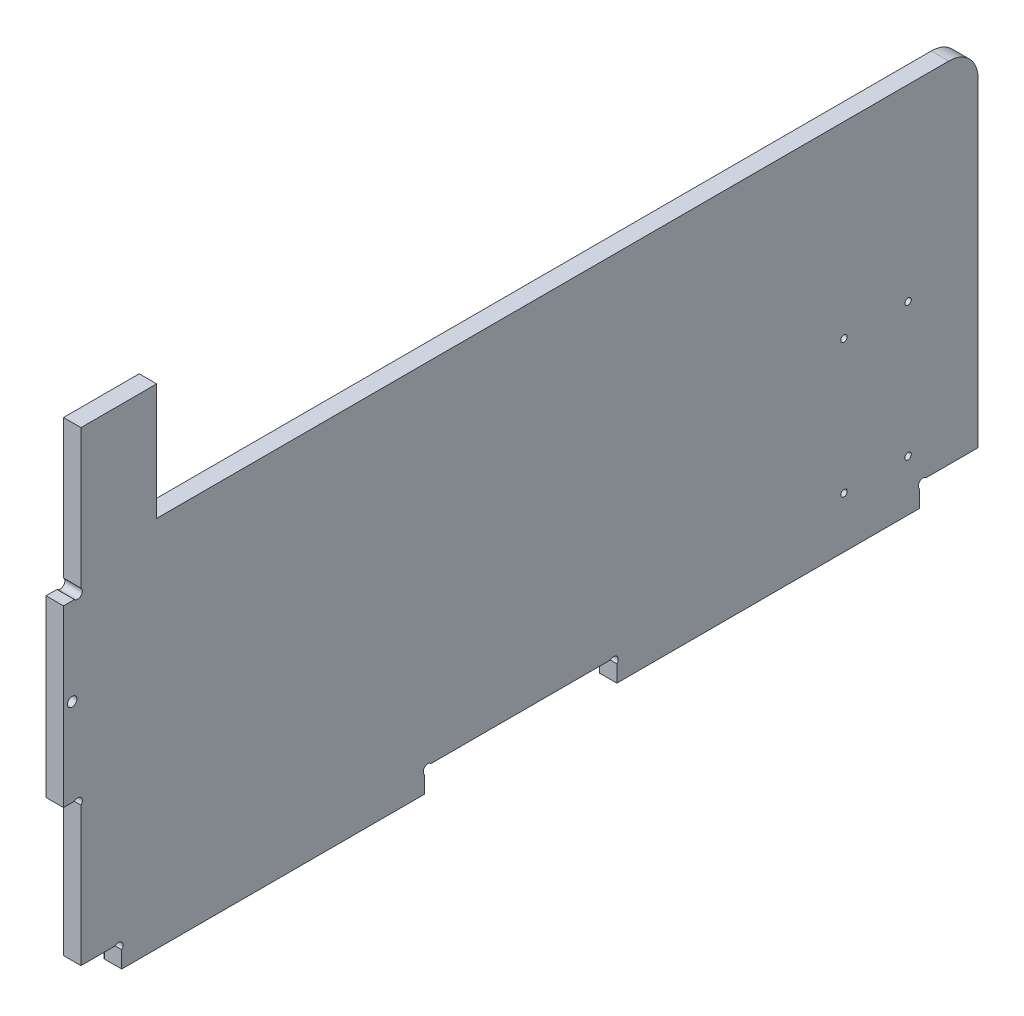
ISO-10303-21;
HEADER;
FILE_DESCRIPTION(('STEP AP214'),'2;1');
FILE_NAME('part.step','',(''),(''),'','','');
FILE_SCHEMA(('AUTOMOTIVE_DESIGN { 1 0 10303 214 1 1 1 1 }'));
ENDSEC;
DATA;
#1=APPLICATION_CONTEXT('core data for automotive mechanical design processes');
#2=APPLICATION_PROTOCOL_DEFINITION('international standard','automotive_design',2000,#1);
#3=PRODUCT_CONTEXT('',#1,'mechanical');
#4=PRODUCT('Part','Part','',(#3));
#5=PRODUCT_RELATED_PRODUCT_CATEGORY('part','',(#4));
#6=PRODUCT_DEFINITION_FORMATION('','',#4);
#7=PRODUCT_DEFINITION_CONTEXT('part definition',#1,'design');
#8=PRODUCT_DEFINITION('design','',#6,#7);
#9=PRODUCT_DEFINITION_SHAPE('','',#8);
#10=(LENGTH_UNIT() NAMED_UNIT(*) SI_UNIT(.MILLI.,.METRE.));
#11=(NAMED_UNIT(*) PLANE_ANGLE_UNIT() SI_UNIT($,.RADIAN.));
#12=(NAMED_UNIT(*) SI_UNIT($,.STERADIAN.) SOLID_ANGLE_UNIT());
#13=UNCERTAINTY_MEASURE_WITH_UNIT(LENGTH_MEASURE(1.E-05),#10,'distance_accuracy_value','');
#14=(GEOMETRIC_REPRESENTATION_CONTEXT(3) GLOBAL_UNCERTAINTY_ASSIGNED_CONTEXT((#13)) GLOBAL_UNIT_ASSIGNED_CONTEXT((#10,
#11,#12)) REPRESENTATION_CONTEXT('',''));
#15=CARTESIAN_POINT('',(0.,0.,0.));
#16=DIRECTION('',(0.,0.,1.));
#17=DIRECTION('',(1.,0.,0.));
#18=AXIS2_PLACEMENT_3D('',#15,#16,#17);
#19=CARTESIAN_POINT('',(6.,118.,-304.));
#20=DIRECTION('',(-1.,0.,0.));
#21=DIRECTION('',(0.,0.,1.));
#22=AXIS2_PLACEMENT_3D('',#19,#20,#21);
#23=PLANE('',#22);
#24=CARTESIAN_POINT('',(6.,63.5,-268.));
#25=DIRECTION('',(1.,0.,0.));
#26=DIRECTION('',(0.,0.,-1.));
#27=AXIS2_PLACEMENT_3D('',#24,#25,#26);
#28=CIRCLE('',#27,1.09999999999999);
#29=CARTESIAN_POINT('',(6.,63.5,-269.1));
#30=VERTEX_POINT('',#29);
#31=EDGE_CURVE('E453',#30,#30,#28,.T.);
#32=ORIENTED_EDGE('',*,*,#31,.F.);
#33=EDGE_LOOP('',(#32));
#34=FACE_BOUND('',#33,.T.);
#35=CARTESIAN_POINT('',(6.,17.5,-268.));
#36=DIRECTION('',(1.,0.,0.));
#37=DIRECTION('',(0.,0.,-1.));
#38=AXIS2_PLACEMENT_3D('',#35,#36,#37);
#39=CIRCLE('',#38,1.09999999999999);
#40=CARTESIAN_POINT('',(6.,17.5,-269.1));
#41=VERTEX_POINT('',#40);
#42=EDGE_CURVE('E465',#41,#41,#39,.T.);
#43=ORIENTED_EDGE('',*,*,#42,.F.);
#44=EDGE_LOOP('',(#43));
#45=FACE_BOUND('',#44,.T.);
#46=DIRECTION('',(0.,0.,1.));
#47=VECTOR('',#46,1.);
#48=CARTESIAN_POINT('',(6.,168.,-6.00000000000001));
#49=LINE('',#48,#47);
#50=CARTESIAN_POINT('',(6.,168.,-32.));
#51=VERTEX_POINT('',#50);
#52=CARTESIAN_POINT('',(6.,168.,-6.00000000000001));
#53=VERTEX_POINT('',#52);
#54=EDGE_CURVE('E265',#51,#53,#49,.T.);
#55=ORIENTED_EDGE('',*,*,#54,.T.);
#56=DIRECTION('',(0.,-1.,0.));
#57=VECTOR('',#56,1.);
#58=CARTESIAN_POINT('',(6.,120.262741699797,-6.00000000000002));
#59=LINE('',#58,#57);
#60=CARTESIAN_POINT('',(6.,120.262741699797,-6.00000000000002));
#61=VERTEX_POINT('',#60);
#62=EDGE_CURVE('E128',#53,#61,#59,.T.);
#63=ORIENTED_EDGE('',*,*,#62,.T.);
#64=CARTESIAN_POINT('',(6.,119.131370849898,-4.86862915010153));
#65=DIRECTION('',(-1.,0.,0.));
#66=DIRECTION('',(0.,0.,-1.));
#67=AXIS2_PLACEMENT_3D('',#64,#65,#66);
#68=CIRCLE('',#67,1.59999999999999);
#69=CARTESIAN_POINT('',(6.,118.,-3.73725830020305));
#70=VERTEX_POINT('',#69);
#71=EDGE_CURVE('E331',#61,#70,#68,.T.);
#72=ORIENTED_EDGE('',*,*,#71,.T.);
#73=DIRECTION('',(0.,0.,1.));
#74=VECTOR('',#73,1.);
#75=CARTESIAN_POINT('',(6.,118.,-3.73725830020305));
#76=LINE('',#75,#74);
#77=CARTESIAN_POINT('',(6.,118.,0.));
#78=VERTEX_POINT('',#77);
#79=EDGE_CURVE('E350',#70,#78,#76,.T.);
#80=ORIENTED_EDGE('',*,*,#79,.T.);
#81=DIRECTION('',(0.,-1.,0.));
#82=VECTOR('',#81,1.);
#83=CARTESIAN_POINT('',(6.,118.,0.));
#84=LINE('',#83,#82);
#85=CARTESIAN_POINT('',(6.,58.,0.));
#86=VERTEX_POINT('',#85);
#87=EDGE_CURVE('E347',#78,#86,#84,.T.);
#88=ORIENTED_EDGE('',*,*,#87,.T.);
#89=DIRECTION('',(0.,0.,-1.));
#90=VECTOR('',#89,1.);
#91=CARTESIAN_POINT('',(6.,58.,0.));
#92=LINE('',#91,#90);
#93=CARTESIAN_POINT('',(6.,58.,-3.73725830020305));
#94=VERTEX_POINT('',#93);
#95=EDGE_CURVE('E349',#86,#94,#92,.T.);
#96=ORIENTED_EDGE('',*,*,#95,.T.);
#97=CARTESIAN_POINT('',(6.,56.8686291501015,-4.86862915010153));
#98=DIRECTION('',(-1.,0.,0.));
#99=DIRECTION('',(0.,0.,1.));
#100=AXIS2_PLACEMENT_3D('',#97,#98,#99);
#101=CIRCLE('',#100,1.6);
#102=CARTESIAN_POINT('',(6.,55.7372583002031,-6.00000000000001));
#103=VERTEX_POINT('',#102);
#104=EDGE_CURVE('E352',#94,#103,#101,.T.);
#105=ORIENTED_EDGE('',*,*,#104,.T.);
#106=DIRECTION('',(0.,-1.,0.));
#107=VECTOR('',#106,1.);
#108=CARTESIAN_POINT('',(6.,55.7372583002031,-6.00000000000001));
#109=LINE('',#108,#107);
#110=CARTESIAN_POINT('',(6.,8.,-6.00000000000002));
#111=VERTEX_POINT('',#110);
#112=EDGE_CURVE('E358',#103,#111,#109,.T.);
#113=ORIENTED_EDGE('',*,*,#112,.T.);
#114=DIRECTION('',(0.,0.,-1.));
#115=VECTOR('',#114,1.);
#116=CARTESIAN_POINT('',(6.,7.99999999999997,-17.7372583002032));
#117=LINE('',#116,#115);
#118=CARTESIAN_POINT('',(6.,7.99999999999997,-17.7372583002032));
#119=VERTEX_POINT('',#118);
#120=EDGE_CURVE('E360',#111,#119,#117,.T.);
#121=ORIENTED_EDGE('',*,*,#120,.T.);
#122=CARTESIAN_POINT('',(6.,6.86862915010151,-18.8686291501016));
#123=DIRECTION('',(-1.,0.,0.));
#124=DIRECTION('',(0.,0.,1.));
#125=AXIS2_PLACEMENT_3D('',#122,#123,#124);
#126=CIRCLE('',#125,1.59999999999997);
#127=CARTESIAN_POINT('',(6.,5.73725830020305,-20.0000000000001));
#128=VERTEX_POINT('',#127);
#129=EDGE_CURVE('E362',#119,#128,#126,.T.);
#130=ORIENTED_EDGE('',*,*,#129,.T.);
#131=DIRECTION('',(0.,-1.,0.));
#132=VECTOR('',#131,1.);
#133=CARTESIAN_POINT('',(6.,5.73725830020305,-20.0000000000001));
#134=LINE('',#133,#132);
#135=CARTESIAN_POINT('',(6.,0.,-20.0000000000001));
#136=VERTEX_POINT('',#135);
#137=EDGE_CURVE('E364',#128,#136,#134,.T.);
#138=ORIENTED_EDGE('',*,*,#137,.T.);
#139=DIRECTION('',(0.,0.,-1.));
#140=VECTOR('',#139,1.);
#141=CARTESIAN_POINT('',(6.,0.,-20.0000000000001));
#142=LINE('',#141,#140);
#143=CARTESIAN_POINT('',(6.,0.,-124.));
#144=VERTEX_POINT('',#143);
#145=EDGE_CURVE('E366',#136,#144,#142,.T.);
#146=ORIENTED_EDGE('',*,*,#145,.T.);
#147=DIRECTION('',(0.,1.,0.));
#148=VECTOR('',#147,1.);
#149=CARTESIAN_POINT('',(6.,0.,-124.));
#150=LINE('',#149,#148);
#151=CARTESIAN_POINT('',(6.,5.73725830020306,-124.));
#152=VERTEX_POINT('',#151);
#153=EDGE_CURVE('E368',#144,#152,#150,.T.);
#154=ORIENTED_EDGE('',*,*,#153,.T.);
#155=CARTESIAN_POINT('',(6.,6.86862915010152,-125.131370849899));
#156=DIRECTION('',(-1.,0.,0.));
#157=DIRECTION('',(0.,0.,-1.));
#158=AXIS2_PLACEMENT_3D('',#155,#156,#157);
#159=CIRCLE('',#158,1.59999999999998);
#160=CARTESIAN_POINT('',(6.,7.99999999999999,-126.262741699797));
#161=VERTEX_POINT('',#160);
#162=EDGE_CURVE('E370',#152,#161,#159,.T.);
#163=ORIENTED_EDGE('',*,*,#162,.T.);
#164=DIRECTION('',(0.,0.,-1.));
#165=VECTOR('',#164,1.);
#166=CARTESIAN_POINT('',(6.,7.99999999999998,-126.262741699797));
#167=LINE('',#166,#165);
#168=CARTESIAN_POINT('',(6.,7.99999999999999,-187.737258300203));
#169=VERTEX_POINT('',#168);
#170=EDGE_CURVE('E372',#161,#169,#167,.T.);
#171=ORIENTED_EDGE('',*,*,#170,.T.);
#172=CARTESIAN_POINT('',(6.,6.86862915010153,-188.868629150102));
#173=DIRECTION('',(-1.,0.,0.));
#174=DIRECTION('',(0.,0.,1.));
#175=AXIS2_PLACEMENT_3D('',#172,#173,#174);
#176=CIRCLE('',#175,1.59999999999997);
#177=CARTESIAN_POINT('',(6.,5.73725830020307,-190.));
#178=VERTEX_POINT('',#177);
#179=EDGE_CURVE('E374',#169,#178,#176,.T.);
#180=ORIENTED_EDGE('',*,*,#179,.T.);
#181=DIRECTION('',(0.,-1.,0.));
#182=VECTOR('',#181,1.);
#183=CARTESIAN_POINT('',(6.,0.,-190.));
#184=LINE('',#183,#182);
#185=CARTESIAN_POINT('',(6.,0.,-190.));
#186=VERTEX_POINT('',#185);
#187=EDGE_CURVE('E376',#178,#186,#184,.T.);
#188=ORIENTED_EDGE('',*,*,#187,.T.);
#189=DIRECTION('',(0.,0.,-1.));
#190=VECTOR('',#189,1.);
#191=CARTESIAN_POINT('',(6.,0.,-294.));
#192=LINE('',#191,#190);
#193=CARTESIAN_POINT('',(6.,0.,-294.));
#194=VERTEX_POINT('',#193);
#195=EDGE_CURVE('E378',#186,#194,#192,.T.);
#196=ORIENTED_EDGE('',*,*,#195,.T.);
#197=DIRECTION('',(0.,1.,0.));
#198=VECTOR('',#197,1.);
#199=CARTESIAN_POINT('',(6.,5.73725830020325,-294.));
#200=LINE('',#199,#198);
#201=CARTESIAN_POINT('',(6.,5.73725830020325,-294.));
#202=VERTEX_POINT('',#201);
#203=EDGE_CURVE('E380',#194,#202,#200,.T.);
#204=ORIENTED_EDGE('',*,*,#203,.T.);
#205=CARTESIAN_POINT('',(6.,6.8686291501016,-295.131370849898));
#206=DIRECTION('',(-1.,0.,0.));
#207=DIRECTION('',(0.,0.,-1.));
#208=AXIS2_PLACEMENT_3D('',#205,#206,#207);
#209=CIRCLE('',#208,1.59999999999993);
#210=CARTESIAN_POINT('',(6.,7.99999999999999,-296.262741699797));
#211=VERTEX_POINT('',#210);
#212=EDGE_CURVE('E382',#202,#211,#209,.T.);
#213=ORIENTED_EDGE('',*,*,#212,.T.);
#214=DIRECTION('',(0.,0.,-1.));
#215=VECTOR('',#214,1.);
#216=CARTESIAN_POINT('',(6.,8.,-314.));
#217=LINE('',#216,#215);
#218=CARTESIAN_POINT('',(6.,8.,-314.));
#219=VERTEX_POINT('',#218);
#220=EDGE_CURVE('E384',#211,#219,#217,.T.);
#221=ORIENTED_EDGE('',*,*,#220,.T.);
#222=DIRECTION('',(0.,1.,0.));
#223=VECTOR('',#222,1.);
#224=CARTESIAN_POINT('',(6.,118.,-314.));
#225=LINE('',#224,#223);
#226=CARTESIAN_POINT('',(6.,118.,-314.));
#227=VERTEX_POINT('',#226);
#228=EDGE_CURVE('E198',#219,#227,#225,.T.);
#229=ORIENTED_EDGE('',*,*,#228,.T.);
#230=CARTESIAN_POINT('',(6.,118.,-304.));
#231=DIRECTION('',(1.,0.,0.));
#232=DIRECTION('',(0.,0.,1.));
#233=AXIS2_PLACEMENT_3D('',#230,#231,#232);
#234=CIRCLE('',#233,9.99999999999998);
#235=CARTESIAN_POINT('',(6.,128.,-304.));
#236=VERTEX_POINT('',#235);
#237=EDGE_CURVE('E192',#227,#236,#234,.T.);
#238=ORIENTED_EDGE('',*,*,#237,.T.);
#239=DIRECTION('',(0.,0.,1.));
#240=VECTOR('',#239,1.);
#241=CARTESIAN_POINT('',(6.,128.,-32.));
#242=LINE('',#241,#240);
#243=CARTESIAN_POINT('',(6.,128.,-32.));
#244=VERTEX_POINT('',#243);
#245=EDGE_CURVE('E196',#236,#244,#242,.T.);
#246=ORIENTED_EDGE('',*,*,#245,.T.);
#247=DIRECTION('',(0.,1.,0.));
#248=VECTOR('',#247,1.);
#249=CARTESIAN_POINT('',(6.,168.,-32.));
#250=LINE('',#249,#248);
#251=EDGE_CURVE('E34',#244,#51,#250,.T.);
#252=ORIENTED_EDGE('',*,*,#251,.T.);
#253=EDGE_LOOP('',(#55,#63,#72,#80,#88,#96,#105,#113,#121,#130,#138,#146,#154,#163,#171,#180,
#188,#196,#204,#213,#221,#229,#238,#246,#252));
#254=FACE_BOUND('',#253,.T.);
#255=CARTESIAN_POINT('',(6.,88.,-3.));
#256=DIRECTION('',(1.,0.,0.));
#257=DIRECTION('',(0.,0.,-1.));
#258=AXIS2_PLACEMENT_3D('',#255,#256,#257);
#259=CIRCLE('',#258,1.6);
#260=CARTESIAN_POINT('',(6.,88.,-4.6));
#261=VERTEX_POINT('',#260);
#262=EDGE_CURVE('E220',#261,#261,#259,.T.);
#263=ORIENTED_EDGE('',*,*,#262,.F.);
#264=EDGE_LOOP('',(#263));
#265=FACE_BOUND('',#264,.T.);
#266=CARTESIAN_POINT('',(6.,17.5,-290.));
#267=DIRECTION('',(1.,0.,0.));
#268=DIRECTION('',(0.,0.,-1.));
#269=AXIS2_PLACEMENT_3D('',#266,#267,#268);
#270=CIRCLE('',#269,1.09999999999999);
#271=CARTESIAN_POINT('',(6.,17.5,-291.1));
#272=VERTEX_POINT('',#271);
#273=EDGE_CURVE('E459',#272,#272,#270,.T.);
#274=ORIENTED_EDGE('',*,*,#273,.F.);
#275=EDGE_LOOP('',(#274));
#276=FACE_BOUND('',#275,.T.);
#277=CARTESIAN_POINT('',(6.,63.5,-290.));
#278=DIRECTION('',(1.,0.,0.));
#279=DIRECTION('',(0.,0.,-1.));
#280=AXIS2_PLACEMENT_3D('',#277,#278,#279);
#281=CIRCLE('',#280,1.09999999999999);
#282=CARTESIAN_POINT('',(6.,63.5,-291.1));
#283=VERTEX_POINT('',#282);
#284=EDGE_CURVE('E444',#283,#283,#281,.T.);
#285=ORIENTED_EDGE('',*,*,#284,.F.);
#286=EDGE_LOOP('',(#285));
#287=FACE_BOUND('',#286,.T.);
#288=ADVANCED_FACE('F17',(#34,#45,#254,#265,#276,#287),#23,.F.);
#289=CARTESIAN_POINT('',(0.,118.,-304.));
#290=DIRECTION('',(-1.,0.,0.));
#291=DIRECTION('',(0.,0.,1.));
#292=AXIS2_PLACEMENT_3D('',#289,#290,#291);
#293=PLANE('',#292);
#294=CARTESIAN_POINT('',(0.,63.5,-268.));
#295=DIRECTION('',(1.,0.,0.));
#296=DIRECTION('',(0.,0.,-1.));
#297=AXIS2_PLACEMENT_3D('',#294,#295,#296);
#298=CIRCLE('',#297,1.09999999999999);
#299=CARTESIAN_POINT('',(0.,63.5,-269.1));
#300=VERTEX_POINT('',#299);
#301=EDGE_CURVE('E450',#300,#300,#298,.T.);
#302=ORIENTED_EDGE('',*,*,#301,.T.);
#303=EDGE_LOOP('',(#302));
#304=FACE_BOUND('',#303,.T.);
#305=CARTESIAN_POINT('',(0.,17.5,-268.));
#306=DIRECTION('',(1.,0.,0.));
#307=DIRECTION('',(0.,0.,-1.));
#308=AXIS2_PLACEMENT_3D('',#305,#306,#307);
#309=CIRCLE('',#308,1.09999999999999);
#310=CARTESIAN_POINT('',(0.,17.5,-269.1));
#311=VERTEX_POINT('',#310);
#312=EDGE_CURVE('E462',#311,#311,#309,.T.);
#313=ORIENTED_EDGE('',*,*,#312,.T.);
#314=EDGE_LOOP('',(#313));
#315=FACE_BOUND('',#314,.T.);
#316=DIRECTION('',(0.,0.,1.));
#317=VECTOR('',#316,1.);
#318=CARTESIAN_POINT('',(0.,168.,-6.00000000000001));
#319=LINE('',#318,#317);
#320=CARTESIAN_POINT('',(0.,168.,-32.));
#321=VERTEX_POINT('',#320);
#322=CARTESIAN_POINT('',(0.,168.,-6.00000000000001));
#323=VERTEX_POINT('',#322);
#324=EDGE_CURVE('E216',#321,#323,#319,.T.);
#325=ORIENTED_EDGE('',*,*,#324,.F.);
#326=DIRECTION('',(0.,1.,0.));
#327=VECTOR('',#326,1.);
#328=CARTESIAN_POINT('',(0.,168.,-32.));
#329=LINE('',#328,#327);
#330=CARTESIAN_POINT('',(0.,128.,-32.));
#331=VERTEX_POINT('',#330);
#332=EDGE_CURVE('E120',#331,#321,#329,.T.);
#333=ORIENTED_EDGE('',*,*,#332,.F.);
#334=DIRECTION('',(0.,0.,1.));
#335=VECTOR('',#334,1.);
#336=CARTESIAN_POINT('',(0.,128.,-32.));
#337=LINE('',#336,#335);
#338=CARTESIAN_POINT('',(0.,128.,-304.));
#339=VERTEX_POINT('',#338);
#340=EDGE_CURVE('E114',#339,#331,#337,.T.);
#341=ORIENTED_EDGE('',*,*,#340,.F.);
#342=CARTESIAN_POINT('',(0.,118.,-304.));
#343=DIRECTION('',(1.,0.,0.));
#344=DIRECTION('',(0.,0.,1.));
#345=AXIS2_PLACEMENT_3D('',#342,#343,#344);
#346=CIRCLE('',#345,9.99999999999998);
#347=CARTESIAN_POINT('',(0.,118.,-314.));
#348=VERTEX_POINT('',#347);
#349=EDGE_CURVE('E206',#348,#339,#346,.T.);
#350=ORIENTED_EDGE('',*,*,#349,.F.);
#351=DIRECTION('',(0.,1.,0.));
#352=VECTOR('',#351,1.);
#353=CARTESIAN_POINT('',(0.,118.,-314.));
#354=LINE('',#353,#352);
#355=CARTESIAN_POINT('',(0.,8.,-314.));
#356=VERTEX_POINT('',#355);
#357=EDGE_CURVE('E260',#356,#348,#354,.T.);
#358=ORIENTED_EDGE('',*,*,#357,.F.);
#359=DIRECTION('',(0.,0.,-1.));
#360=VECTOR('',#359,1.);
#361=CARTESIAN_POINT('',(0.,8.,-314.));
#362=LINE('',#361,#360);
#363=CARTESIAN_POINT('',(0.,7.99999999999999,-296.262741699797));
#364=VERTEX_POINT('',#363);
#365=EDGE_CURVE('E258',#364,#356,#362,.T.);
#366=ORIENTED_EDGE('',*,*,#365,.F.);
#367=CARTESIAN_POINT('',(0.,6.8686291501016,-295.131370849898));
#368=DIRECTION('',(-1.,0.,0.));
#369=DIRECTION('',(0.,0.,-1.));
#370=AXIS2_PLACEMENT_3D('',#367,#368,#369);
#371=CIRCLE('',#370,1.59999999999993);
#372=CARTESIAN_POINT('',(0.,5.73725830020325,-294.));
#373=VERTEX_POINT('',#372);
#374=EDGE_CURVE('E256',#373,#364,#371,.T.);
#375=ORIENTED_EDGE('',*,*,#374,.F.);
#376=DIRECTION('',(0.,1.,0.));
#377=VECTOR('',#376,1.);
#378=CARTESIAN_POINT('',(0.,5.73725830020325,-294.));
#379=LINE('',#378,#377);
#380=CARTESIAN_POINT('',(0.,0.,-294.));
#381=VERTEX_POINT('',#380);
#382=EDGE_CURVE('E254',#381,#373,#379,.T.);
#383=ORIENTED_EDGE('',*,*,#382,.F.);
#384=DIRECTION('',(0.,0.,-1.));
#385=VECTOR('',#384,1.);
#386=CARTESIAN_POINT('',(0.,0.,-294.));
#387=LINE('',#386,#385);
#388=CARTESIAN_POINT('',(0.,0.,-190.));
#389=VERTEX_POINT('',#388);
#390=EDGE_CURVE('E252',#389,#381,#387,.T.);
#391=ORIENTED_EDGE('',*,*,#390,.F.);
#392=DIRECTION('',(0.,-1.,0.));
#393=VECTOR('',#392,1.);
#394=CARTESIAN_POINT('',(0.,0.,-190.));
#395=LINE('',#394,#393);
#396=CARTESIAN_POINT('',(0.,5.73725830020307,-190.));
#397=VERTEX_POINT('',#396);
#398=EDGE_CURVE('E250',#397,#389,#395,.T.);
#399=ORIENTED_EDGE('',*,*,#398,.F.);
#400=CARTESIAN_POINT('',(0.,6.86862915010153,-188.868629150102));
#401=DIRECTION('',(-1.,0.,0.));
#402=DIRECTION('',(0.,0.,1.));
#403=AXIS2_PLACEMENT_3D('',#400,#401,#402);
#404=CIRCLE('',#403,1.59999999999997);
#405=CARTESIAN_POINT('',(0.,7.99999999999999,-187.737258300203));
#406=VERTEX_POINT('',#405);
#407=EDGE_CURVE('E248',#406,#397,#404,.T.);
#408=ORIENTED_EDGE('',*,*,#407,.F.);
#409=DIRECTION('',(0.,0.,-1.));
#410=VECTOR('',#409,1.);
#411=CARTESIAN_POINT('',(0.,7.99999999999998,-126.262741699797));
#412=LINE('',#411,#410);
#413=CARTESIAN_POINT('',(0.,7.99999999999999,-126.262741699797));
#414=VERTEX_POINT('',#413);
#415=EDGE_CURVE('E246',#414,#406,#412,.T.);
#416=ORIENTED_EDGE('',*,*,#415,.F.);
#417=CARTESIAN_POINT('',(0.,6.86862915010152,-125.131370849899));
#418=DIRECTION('',(-1.,0.,0.));
#419=DIRECTION('',(0.,0.,-1.));
#420=AXIS2_PLACEMENT_3D('',#417,#418,#419);
#421=CIRCLE('',#420,1.59999999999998);
#422=CARTESIAN_POINT('',(0.,5.73725830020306,-124.));
#423=VERTEX_POINT('',#422);
#424=EDGE_CURVE('E244',#423,#414,#421,.T.);
#425=ORIENTED_EDGE('',*,*,#424,.F.);
#426=DIRECTION('',(0.,1.,0.));
#427=VECTOR('',#426,1.);
#428=CARTESIAN_POINT('',(0.,0.,-124.));
#429=LINE('',#428,#427);
#430=CARTESIAN_POINT('',(0.,0.,-124.));
#431=VERTEX_POINT('',#430);
#432=EDGE_CURVE('E242',#431,#423,#429,.T.);
#433=ORIENTED_EDGE('',*,*,#432,.F.);
#434=DIRECTION('',(0.,0.,-1.));
#435=VECTOR('',#434,1.);
#436=CARTESIAN_POINT('',(0.,0.,-20.0000000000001));
#437=LINE('',#436,#435);
#438=CARTESIAN_POINT('',(0.,0.,-20.0000000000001));
#439=VERTEX_POINT('',#438);
#440=EDGE_CURVE('E240',#439,#431,#437,.T.);
#441=ORIENTED_EDGE('',*,*,#440,.F.);
#442=DIRECTION('',(0.,-1.,0.));
#443=VECTOR('',#442,1.);
#444=CARTESIAN_POINT('',(0.,5.73725830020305,-20.0000000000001));
#445=LINE('',#444,#443);
#446=CARTESIAN_POINT('',(0.,5.73725830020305,-20.0000000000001));
#447=VERTEX_POINT('',#446);
#448=EDGE_CURVE('E238',#447,#439,#445,.T.);
#449=ORIENTED_EDGE('',*,*,#448,.F.);
#450=CARTESIAN_POINT('',(0.,6.86862915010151,-18.8686291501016));
#451=DIRECTION('',(-1.,0.,0.));
#452=DIRECTION('',(0.,0.,1.));
#453=AXIS2_PLACEMENT_3D('',#450,#451,#452);
#454=CIRCLE('',#453,1.59999999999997);
#455=CARTESIAN_POINT('',(0.,7.99999999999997,-17.7372583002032));
#456=VERTEX_POINT('',#455);
#457=EDGE_CURVE('E236',#456,#447,#454,.T.);
#458=ORIENTED_EDGE('',*,*,#457,.F.);
#459=DIRECTION('',(0.,0.,-1.));
#460=VECTOR('',#459,1.);
#461=CARTESIAN_POINT('',(0.,7.99999999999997,-17.7372583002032));
#462=LINE('',#461,#460);
#463=CARTESIAN_POINT('',(0.,8.,-6.00000000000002));
#464=VERTEX_POINT('',#463);
#465=EDGE_CURVE('E234',#464,#456,#462,.T.);
#466=ORIENTED_EDGE('',*,*,#465,.F.);
#467=DIRECTION('',(0.,-1.,0.));
#468=VECTOR('',#467,1.);
#469=CARTESIAN_POINT('',(0.,55.7372583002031,-6.00000000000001));
#470=LINE('',#469,#468);
#471=CARTESIAN_POINT('',(0.,55.7372583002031,-6.00000000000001));
#472=VERTEX_POINT('',#471);
#473=EDGE_CURVE('E232',#472,#464,#470,.T.);
#474=ORIENTED_EDGE('',*,*,#473,.F.);
#475=CARTESIAN_POINT('',(0.,56.8686291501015,-4.86862915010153));
#476=DIRECTION('',(-1.,0.,0.));
#477=DIRECTION('',(0.,0.,1.));
#478=AXIS2_PLACEMENT_3D('',#475,#476,#477);
#479=CIRCLE('',#478,1.6);
#480=CARTESIAN_POINT('',(0.,58.,-3.73725830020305));
#481=VERTEX_POINT('',#480);
#482=EDGE_CURVE('E230',#481,#472,#479,.T.);
#483=ORIENTED_EDGE('',*,*,#482,.F.);
#484=DIRECTION('',(0.,0.,-1.));
#485=VECTOR('',#484,1.);
#486=CARTESIAN_POINT('',(0.,58.,0.));
#487=LINE('',#486,#485);
#488=CARTESIAN_POINT('',(0.,58.,0.));
#489=VERTEX_POINT('',#488);
#490=EDGE_CURVE('E228',#489,#481,#487,.T.);
#491=ORIENTED_EDGE('',*,*,#490,.F.);
#492=DIRECTION('',(0.,-1.,0.));
#493=VECTOR('',#492,1.);
#494=CARTESIAN_POINT('',(0.,118.,0.));
#495=LINE('',#494,#493);
#496=CARTESIAN_POINT('',(0.,118.,0.));
#497=VERTEX_POINT('',#496);
#498=EDGE_CURVE('E226',#497,#489,#495,.T.);
#499=ORIENTED_EDGE('',*,*,#498,.F.);
#500=DIRECTION('',(0.,0.,1.));
#501=VECTOR('',#500,1.);
#502=CARTESIAN_POINT('',(0.,118.,-3.73725830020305));
#503=LINE('',#502,#501);
#504=CARTESIAN_POINT('',(0.,118.,-3.73725830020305));
#505=VERTEX_POINT('',#504);
#506=EDGE_CURVE('E224',#505,#497,#503,.T.);
#507=ORIENTED_EDGE('',*,*,#506,.F.);
#508=CARTESIAN_POINT('',(0.,119.131370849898,-4.86862915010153));
#509=DIRECTION('',(-1.,0.,0.));
#510=DIRECTION('',(0.,0.,-1.));
#511=AXIS2_PLACEMENT_3D('',#508,#509,#510);
#512=CIRCLE('',#511,1.59999999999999);
#513=CARTESIAN_POINT('',(0.,120.262741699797,-6.00000000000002));
#514=VERTEX_POINT('',#513);
#515=EDGE_CURVE('E222',#514,#505,#512,.T.);
#516=ORIENTED_EDGE('',*,*,#515,.F.);
#517=DIRECTION('',(0.,-1.,0.));
#518=VECTOR('',#517,1.);
#519=CARTESIAN_POINT('',(0.,120.262741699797,-6.00000000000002));
#520=LINE('',#519,#518);
#521=EDGE_CURVE('E219',#323,#514,#520,.T.);
#522=ORIENTED_EDGE('',*,*,#521,.F.);
#523=EDGE_LOOP('',(#325,#333,#341,#350,#358,#366,#375,#383,#391,#399,#408,#416,#425,#433,#441,
#449,#458,#466,#474,#483,#491,#499,#507,#516,#522));
#524=FACE_BOUND('',#523,.T.);
#525=CARTESIAN_POINT('',(0.,88.,-3.));
#526=DIRECTION('',(1.,0.,0.));
#527=DIRECTION('',(0.,0.,-1.));
#528=AXIS2_PLACEMENT_3D('',#525,#526,#527);
#529=CIRCLE('',#528,1.6);
#530=CARTESIAN_POINT('',(0.,88.,-4.6));
#531=VERTEX_POINT('',#530);
#532=EDGE_CURVE('E468',#531,#531,#529,.T.);
#533=ORIENTED_EDGE('',*,*,#532,.T.);
#534=EDGE_LOOP('',(#533));
#535=FACE_BOUND('',#534,.T.);
#536=CARTESIAN_POINT('',(0.,17.5,-290.));
#537=DIRECTION('',(1.,0.,0.));
#538=DIRECTION('',(0.,0.,-1.));
#539=AXIS2_PLACEMENT_3D('',#536,#537,#538);
#540=CIRCLE('',#539,1.09999999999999);
#541=CARTESIAN_POINT('',(0.,17.5,-291.1));
#542=VERTEX_POINT('',#541);
#543=EDGE_CURVE('E456',#542,#542,#540,.T.);
#544=ORIENTED_EDGE('',*,*,#543,.T.);
#545=EDGE_LOOP('',(#544));
#546=FACE_BOUND('',#545,.T.);
#547=CARTESIAN_POINT('',(0.,63.5,-290.));
#548=DIRECTION('',(1.,0.,0.));
#549=DIRECTION('',(0.,0.,-1.));
#550=AXIS2_PLACEMENT_3D('',#547,#548,#549);
#551=CIRCLE('',#550,1.09999999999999);
#552=CARTESIAN_POINT('',(0.,63.5,-291.1));
#553=VERTEX_POINT('',#552);
#554=EDGE_CURVE('E447',#553,#553,#551,.T.);
#555=ORIENTED_EDGE('',*,*,#554,.T.);
#556=EDGE_LOOP('',(#555));
#557=FACE_BOUND('',#556,.T.);
#558=ADVANCED_FACE('F335',(#304,#315,#524,#535,#546,#557),#293,.T.);
#559=CARTESIAN_POINT('',(6.,168.,-6.00000000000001));
#560=DIRECTION('',(0.,-1.,0.));
#561=DIRECTION('',(0.,0.,-1.));
#562=AXIS2_PLACEMENT_3D('',#559,#560,#561);
#563=PLANE('',#562);
#564=ORIENTED_EDGE('',*,*,#324,.T.);
#565=DIRECTION('',(-1.,0.,0.));
#566=VECTOR('',#565,1.);
#567=CARTESIAN_POINT('',(6.,168.,-6.00000000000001));
#568=LINE('',#567,#566);
#569=EDGE_CURVE('E11',#53,#323,#568,.T.);
#570=ORIENTED_EDGE('',*,*,#569,.F.);
#571=ORIENTED_EDGE('',*,*,#54,.F.);
#572=DIRECTION('',(-1.,0.,0.));
#573=VECTOR('',#572,1.);
#574=CARTESIAN_POINT('',(6.,168.,-32.));
#575=LINE('',#574,#573);
#576=EDGE_CURVE('E212',#51,#321,#575,.T.);
#577=ORIENTED_EDGE('',*,*,#576,.T.);
#578=EDGE_LOOP('',(#564,#570,#571,#577));
#579=FACE_BOUND('',#578,.T.);
#580=ADVANCED_FACE('F19',(#579),#563,.F.);
#581=CARTESIAN_POINT('',(6.,120.262741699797,-6.00000000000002));
#582=DIRECTION('',(0.,0.,-1.));
#583=DIRECTION('',(0.,1.,0.));
#584=AXIS2_PLACEMENT_3D('',#581,#582,#583);
#585=PLANE('',#584);
#586=ORIENTED_EDGE('',*,*,#521,.T.);
#587=DIRECTION('',(-1.,0.,0.));
#588=VECTOR('',#587,1.);
#589=CARTESIAN_POINT('',(6.,120.262741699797,-6.00000000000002));
#590=LINE('',#589,#588);
#591=EDGE_CURVE('E26',#61,#514,#590,.T.);
#592=ORIENTED_EDGE('',*,*,#591,.F.);
#593=ORIENTED_EDGE('',*,*,#62,.F.);
#594=ORIENTED_EDGE('',*,*,#569,.T.);
#595=EDGE_LOOP('',(#586,#592,#593,#594));
#596=FACE_BOUND('',#595,.T.);
#597=ADVANCED_FACE('F724',(#596),#585,.F.);
#598=CARTESIAN_POINT('',(6.,119.131370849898,-4.86862915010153));
#599=DIRECTION('',(-1.,0.,0.));
#600=DIRECTION('',(0.,0.,1.));
#601=AXIS2_PLACEMENT_3D('',#598,#599,#600);
#602=CYLINDRICAL_SURFACE('',#601,1.59999999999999);
#603=ORIENTED_EDGE('',*,*,#515,.T.);
#604=DIRECTION('',(-1.,0.,0.));
#605=VECTOR('',#604,1.);
#606=CARTESIAN_POINT('',(6.,118.,-3.73725830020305));
#607=LINE('',#606,#605);
#608=EDGE_CURVE('E323',#70,#505,#607,.T.);
#609=ORIENTED_EDGE('',*,*,#608,.F.);
#610=ORIENTED_EDGE('',*,*,#71,.F.);
#611=ORIENTED_EDGE('',*,*,#591,.T.);
#612=EDGE_LOOP('',(#603,#609,#610,#611));
#613=FACE_BOUND('',#612,.T.);
#614=ADVANCED_FACE('F329',(#613),#602,.F.);
#615=CARTESIAN_POINT('',(6.,118.,-3.73725830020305));
#616=DIRECTION('',(0.,-1.,0.));
#617=DIRECTION('',(0.,0.,-1.));
#618=AXIS2_PLACEMENT_3D('',#615,#616,#617);
#619=PLANE('',#618);
#620=ORIENTED_EDGE('',*,*,#506,.T.);
#621=DIRECTION('',(-1.,0.,0.));
#622=VECTOR('',#621,1.);
#623=CARTESIAN_POINT('',(6.,118.,0.));
#624=LINE('',#623,#622);
#625=EDGE_CURVE('E320',#78,#497,#624,.T.);
#626=ORIENTED_EDGE('',*,*,#625,.F.);
#627=ORIENTED_EDGE('',*,*,#79,.F.);
#628=ORIENTED_EDGE('',*,*,#608,.T.);
#629=EDGE_LOOP('',(#620,#626,#627,#628));
#630=FACE_BOUND('',#629,.T.);
#631=ADVANCED_FACE('F341',(#630),#619,.F.);
#632=CARTESIAN_POINT('',(6.,118.,0.));
#633=DIRECTION('',(0.,0.,-1.));
#634=DIRECTION('',(0.,1.,0.));
#635=AXIS2_PLACEMENT_3D('',#632,#633,#634);
#636=PLANE('',#635);
#637=ORIENTED_EDGE('',*,*,#498,.T.);
#638=DIRECTION('',(-1.,0.,0.));
#639=VECTOR('',#638,1.);
#640=CARTESIAN_POINT('',(6.,58.,0.));
#641=LINE('',#640,#639);
#642=EDGE_CURVE('E317',#86,#489,#641,.T.);
#643=ORIENTED_EDGE('',*,*,#642,.F.);
#644=ORIENTED_EDGE('',*,*,#87,.F.);
#645=ORIENTED_EDGE('',*,*,#625,.T.);
#646=EDGE_LOOP('',(#637,#643,#644,#645));
#647=FACE_BOUND('',#646,.T.);
#648=ADVANCED_FACE('F345',(#647),#636,.F.);
#649=CARTESIAN_POINT('',(6.,58.,0.));
#650=DIRECTION('',(0.,1.,0.));
#651=DIRECTION('',(0.,0.,1.));
#652=AXIS2_PLACEMENT_3D('',#649,#650,#651);
#653=PLANE('',#652);
#654=ORIENTED_EDGE('',*,*,#490,.T.);
#655=DIRECTION('',(-1.,0.,0.));
#656=VECTOR('',#655,1.);
#657=CARTESIAN_POINT('',(6.,58.,-3.73725830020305));
#658=LINE('',#657,#656);
#659=EDGE_CURVE('E314',#94,#481,#658,.T.);
#660=ORIENTED_EDGE('',*,*,#659,.F.);
#661=ORIENTED_EDGE('',*,*,#95,.F.);
#662=ORIENTED_EDGE('',*,*,#642,.T.);
#663=EDGE_LOOP('',(#654,#660,#661,#662));
#664=FACE_BOUND('',#663,.T.);
#665=ADVANCED_FACE('F689',(#664),#653,.F.);
#666=CARTESIAN_POINT('',(6.,56.8686291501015,-4.86862915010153));
#667=DIRECTION('',(-1.,0.,0.));
#668=DIRECTION('',(0.,0.,1.));
#669=AXIS2_PLACEMENT_3D('',#666,#667,#668);
#670=CYLINDRICAL_SURFACE('',#669,1.6);
#671=ORIENTED_EDGE('',*,*,#482,.T.);
#672=DIRECTION('',(-1.,0.,0.));
#673=VECTOR('',#672,1.);
#674=CARTESIAN_POINT('',(6.,55.7372583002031,-6.00000000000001));
#675=LINE('',#674,#673);
#676=EDGE_CURVE('E311',#103,#472,#675,.T.);
#677=ORIENTED_EDGE('',*,*,#676,.F.);
#678=ORIENTED_EDGE('',*,*,#104,.F.);
#679=ORIENTED_EDGE('',*,*,#659,.T.);
#680=EDGE_LOOP('',(#671,#677,#678,#679));
#681=FACE_BOUND('',#680,.T.);
#682=ADVANCED_FACE('F679',(#681),#670,.F.);
#683=CARTESIAN_POINT('',(6.,55.7372583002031,-6.00000000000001));
#684=DIRECTION('',(0.,0.,-1.));
#685=DIRECTION('',(0.,1.,0.));
#686=AXIS2_PLACEMENT_3D('',#683,#684,#685);
#687=PLANE('',#686);
#688=ORIENTED_EDGE('',*,*,#473,.T.);
#689=DIRECTION('',(-1.,0.,0.));
#690=VECTOR('',#689,1.);
#691=CARTESIAN_POINT('',(6.,8.,-6.00000000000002));
#692=LINE('',#691,#690);
#693=EDGE_CURVE('E308',#111,#464,#692,.T.);
#694=ORIENTED_EDGE('',*,*,#693,.F.);
#695=ORIENTED_EDGE('',*,*,#112,.F.);
#696=ORIENTED_EDGE('',*,*,#676,.T.);
#697=EDGE_LOOP('',(#688,#694,#695,#696));
#698=FACE_BOUND('',#697,.T.);
#699=ADVANCED_FACE('F669',(#698),#687,.F.);
#700=CARTESIAN_POINT('',(6.,7.99999999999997,-17.7372583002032));
#701=DIRECTION('',(0.,1.,0.));
#702=DIRECTION('',(0.,0.,1.));
#703=AXIS2_PLACEMENT_3D('',#700,#701,#702);
#704=PLANE('',#703);
#705=ORIENTED_EDGE('',*,*,#465,.T.);
#706=DIRECTION('',(-1.,0.,0.));
#707=VECTOR('',#706,1.);
#708=CARTESIAN_POINT('',(6.,7.99999999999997,-17.7372583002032));
#709=LINE('',#708,#707);
#710=EDGE_CURVE('E305',#119,#456,#709,.T.);
#711=ORIENTED_EDGE('',*,*,#710,.F.);
#712=ORIENTED_EDGE('',*,*,#120,.F.);
#713=ORIENTED_EDGE('',*,*,#693,.T.);
#714=EDGE_LOOP('',(#705,#711,#712,#713));
#715=FACE_BOUND('',#714,.T.);
#716=ADVANCED_FACE('F659',(#715),#704,.F.);
#717=CARTESIAN_POINT('',(6.,6.86862915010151,-18.8686291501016));
#718=DIRECTION('',(-1.,0.,0.));
#719=DIRECTION('',(0.,0.,1.));
#720=AXIS2_PLACEMENT_3D('',#717,#718,#719);
#721=CYLINDRICAL_SURFACE('',#720,1.59999999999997);
#722=ORIENTED_EDGE('',*,*,#457,.T.);
#723=DIRECTION('',(-1.,0.,0.));
#724=VECTOR('',#723,1.);
#725=CARTESIAN_POINT('',(6.,5.73725830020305,-20.0000000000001));
#726=LINE('',#725,#724);
#727=EDGE_CURVE('E302',#128,#447,#726,.T.);
#728=ORIENTED_EDGE('',*,*,#727,.F.);
#729=ORIENTED_EDGE('',*,*,#129,.F.);
#730=ORIENTED_EDGE('',*,*,#710,.T.);
#731=EDGE_LOOP('',(#722,#728,#729,#730));
#732=FACE_BOUND('',#731,.T.);
#733=ADVANCED_FACE('F649',(#732),#721,.F.);
#734=CARTESIAN_POINT('',(6.,5.73725830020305,-20.0000000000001));
#735=DIRECTION('',(0.,0.,-1.));
#736=DIRECTION('',(-1.,0.,0.));
#737=AXIS2_PLACEMENT_3D('',#734,#735,#736);
#738=PLANE('',#737);
#739=ORIENTED_EDGE('',*,*,#448,.T.);
#740=DIRECTION('',(-1.,0.,0.));
#741=VECTOR('',#740,1.);
#742=CARTESIAN_POINT('',(6.,0.,-20.0000000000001));
#743=LINE('',#742,#741);
#744=EDGE_CURVE('E299',#136,#439,#743,.T.);
#745=ORIENTED_EDGE('',*,*,#744,.F.);
#746=ORIENTED_EDGE('',*,*,#137,.F.);
#747=ORIENTED_EDGE('',*,*,#727,.T.);
#748=EDGE_LOOP('',(#739,#745,#746,#747));
#749=FACE_BOUND('',#748,.T.);
#750=ADVANCED_FACE('F639',(#749),#738,.F.);
#751=CARTESIAN_POINT('',(6.,0.,-20.0000000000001));
#752=DIRECTION('',(0.,1.,0.));
#753=DIRECTION('',(0.,0.,1.));
#754=AXIS2_PLACEMENT_3D('',#751,#752,#753);
#755=PLANE('',#754);
#756=ORIENTED_EDGE('',*,*,#440,.T.);
#757=DIRECTION('',(-1.,0.,0.));
#758=VECTOR('',#757,1.);
#759=CARTESIAN_POINT('',(6.,0.,-124.));
#760=LINE('',#759,#758);
#761=EDGE_CURVE('E296',#144,#431,#760,.T.);
#762=ORIENTED_EDGE('',*,*,#761,.F.);
#763=ORIENTED_EDGE('',*,*,#145,.F.);
#764=ORIENTED_EDGE('',*,*,#744,.T.);
#765=EDGE_LOOP('',(#756,#762,#763,#764));
#766=FACE_BOUND('',#765,.T.);
#767=ADVANCED_FACE('F629',(#766),#755,.F.);
#768=CARTESIAN_POINT('',(6.,0.,-124.));
#769=DIRECTION('',(0.,0.,1.));
#770=DIRECTION('',(0.,-1.,0.));
#771=AXIS2_PLACEMENT_3D('',#768,#769,#770);
#772=PLANE('',#771);
#773=ORIENTED_EDGE('',*,*,#432,.T.);
#774=DIRECTION('',(-1.,0.,0.));
#775=VECTOR('',#774,1.);
#776=CARTESIAN_POINT('',(6.,5.73725830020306,-124.));
#777=LINE('',#776,#775);
#778=EDGE_CURVE('E293',#152,#423,#777,.T.);
#779=ORIENTED_EDGE('',*,*,#778,.F.);
#780=ORIENTED_EDGE('',*,*,#153,.F.);
#781=ORIENTED_EDGE('',*,*,#761,.T.);
#782=EDGE_LOOP('',(#773,#779,#780,#781));
#783=FACE_BOUND('',#782,.T.);
#784=ADVANCED_FACE('F619',(#783),#772,.F.);
#785=CARTESIAN_POINT('',(6.,6.86862915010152,-125.131370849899));
#786=DIRECTION('',(-1.,0.,0.));
#787=DIRECTION('',(0.,0.,1.));
#788=AXIS2_PLACEMENT_3D('',#785,#786,#787);
#789=CYLINDRICAL_SURFACE('',#788,1.59999999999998);
#790=ORIENTED_EDGE('',*,*,#424,.T.);
#791=DIRECTION('',(-1.,0.,0.));
#792=VECTOR('',#791,1.);
#793=CARTESIAN_POINT('',(6.,7.99999999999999,-126.262741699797));
#794=LINE('',#793,#792);
#795=EDGE_CURVE('E290',#161,#414,#794,.T.);
#796=ORIENTED_EDGE('',*,*,#795,.F.);
#797=ORIENTED_EDGE('',*,*,#162,.F.);
#798=ORIENTED_EDGE('',*,*,#778,.T.);
#799=EDGE_LOOP('',(#790,#796,#797,#798));
#800=FACE_BOUND('',#799,.T.);
#801=ADVANCED_FACE('F609',(#800),#789,.F.);
#802=CARTESIAN_POINT('',(6.,7.99999999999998,-126.262741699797));
#803=DIRECTION('',(0.,1.,0.));
#804=DIRECTION('',(0.,0.,1.));
#805=AXIS2_PLACEMENT_3D('',#802,#803,#804);
#806=PLANE('',#805);
#807=ORIENTED_EDGE('',*,*,#415,.T.);
#808=DIRECTION('',(-1.,0.,0.));
#809=VECTOR('',#808,1.);
#810=CARTESIAN_POINT('',(6.,7.99999999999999,-187.737258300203));
#811=LINE('',#810,#809);
#812=EDGE_CURVE('E287',#169,#406,#811,.T.);
#813=ORIENTED_EDGE('',*,*,#812,.F.);
#814=ORIENTED_EDGE('',*,*,#170,.F.);
#815=ORIENTED_EDGE('',*,*,#795,.T.);
#816=EDGE_LOOP('',(#807,#813,#814,#815));
#817=FACE_BOUND('',#816,.T.);
#818=ADVANCED_FACE('F599',(#817),#806,.F.);
#819=CARTESIAN_POINT('',(6.,6.86862915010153,-188.868629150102));
#820=DIRECTION('',(-1.,0.,0.));
#821=DIRECTION('',(0.,0.,1.));
#822=AXIS2_PLACEMENT_3D('',#819,#820,#821);
#823=CYLINDRICAL_SURFACE('',#822,1.59999999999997);
#824=ORIENTED_EDGE('',*,*,#407,.T.);
#825=DIRECTION('',(-1.,0.,0.));
#826=VECTOR('',#825,1.);
#827=CARTESIAN_POINT('',(6.,5.73725830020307,-190.));
#828=LINE('',#827,#826);
#829=EDGE_CURVE('E284',#178,#397,#828,.T.);
#830=ORIENTED_EDGE('',*,*,#829,.F.);
#831=ORIENTED_EDGE('',*,*,#179,.F.);
#832=ORIENTED_EDGE('',*,*,#812,.T.);
#833=EDGE_LOOP('',(#824,#830,#831,#832));
#834=FACE_BOUND('',#833,.T.);
#835=ADVANCED_FACE('F589',(#834),#823,.F.);
#836=CARTESIAN_POINT('',(6.,0.,-190.));
#837=DIRECTION('',(0.,0.,-1.));
#838=DIRECTION('',(-1.,0.,0.));
#839=AXIS2_PLACEMENT_3D('',#836,#837,#838);
#840=PLANE('',#839);
#841=ORIENTED_EDGE('',*,*,#398,.T.);
#842=DIRECTION('',(-1.,0.,0.));
#843=VECTOR('',#842,1.);
#844=CARTESIAN_POINT('',(6.,0.,-190.));
#845=LINE('',#844,#843);
#846=EDGE_CURVE('E281',#186,#389,#845,.T.);
#847=ORIENTED_EDGE('',*,*,#846,.F.);
#848=ORIENTED_EDGE('',*,*,#187,.F.);
#849=ORIENTED_EDGE('',*,*,#829,.T.);
#850=EDGE_LOOP('',(#841,#847,#848,#849));
#851=FACE_BOUND('',#850,.T.);
#852=ADVANCED_FACE('F579',(#851),#840,.F.);
#853=CARTESIAN_POINT('',(6.,0.,-294.));
#854=DIRECTION('',(0.,1.,0.));
#855=DIRECTION('',(0.,0.,1.));
#856=AXIS2_PLACEMENT_3D('',#853,#854,#855);
#857=PLANE('',#856);
#858=ORIENTED_EDGE('',*,*,#390,.T.);
#859=DIRECTION('',(-1.,0.,0.));
#860=VECTOR('',#859,1.);
#861=CARTESIAN_POINT('',(6.,0.,-294.));
#862=LINE('',#861,#860);
#863=EDGE_CURVE('E278',#194,#381,#862,.T.);
#864=ORIENTED_EDGE('',*,*,#863,.F.);
#865=ORIENTED_EDGE('',*,*,#195,.F.);
#866=ORIENTED_EDGE('',*,*,#846,.T.);
#867=EDGE_LOOP('',(#858,#864,#865,#866));
#868=FACE_BOUND('',#867,.T.);
#869=ADVANCED_FACE('F569',(#868),#857,.F.);
#870=CARTESIAN_POINT('',(6.,5.73725830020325,-294.));
#871=DIRECTION('',(0.,0.,1.));
#872=DIRECTION('',(0.,-1.,0.));
#873=AXIS2_PLACEMENT_3D('',#870,#871,#872);
#874=PLANE('',#873);
#875=ORIENTED_EDGE('',*,*,#382,.T.);
#876=DIRECTION('',(-1.,0.,0.));
#877=VECTOR('',#876,1.);
#878=CARTESIAN_POINT('',(6.,5.73725830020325,-294.));
#879=LINE('',#878,#877);
#880=EDGE_CURVE('E275',#202,#373,#879,.T.);
#881=ORIENTED_EDGE('',*,*,#880,.F.);
#882=ORIENTED_EDGE('',*,*,#203,.F.);
#883=ORIENTED_EDGE('',*,*,#863,.T.);
#884=EDGE_LOOP('',(#875,#881,#882,#883));
#885=FACE_BOUND('',#884,.T.);
#886=ADVANCED_FACE('F559',(#885),#874,.F.);
#887=CARTESIAN_POINT('',(6.,6.8686291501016,-295.131370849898));
#888=DIRECTION('',(-1.,0.,0.));
#889=DIRECTION('',(0.,0.,1.));
#890=AXIS2_PLACEMENT_3D('',#887,#888,#889);
#891=CYLINDRICAL_SURFACE('',#890,1.59999999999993);
#892=ORIENTED_EDGE('',*,*,#374,.T.);
#893=DIRECTION('',(-1.,0.,0.));
#894=VECTOR('',#893,1.);
#895=CARTESIAN_POINT('',(6.,7.99999999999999,-296.262741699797));
#896=LINE('',#895,#894);
#897=EDGE_CURVE('E272',#211,#364,#896,.T.);
#898=ORIENTED_EDGE('',*,*,#897,.F.);
#899=ORIENTED_EDGE('',*,*,#212,.F.);
#900=ORIENTED_EDGE('',*,*,#880,.T.);
#901=EDGE_LOOP('',(#892,#898,#899,#900));
#902=FACE_BOUND('',#901,.T.);
#903=ADVANCED_FACE('F550',(#902),#891,.F.);
#904=CARTESIAN_POINT('',(6.,8.,-314.));
#905=DIRECTION('',(0.,1.,0.));
#906=DIRECTION('',(0.,0.,1.));
#907=AXIS2_PLACEMENT_3D('',#904,#905,#906);
#908=PLANE('',#907);
#909=ORIENTED_EDGE('',*,*,#365,.T.);
#910=DIRECTION('',(-1.,0.,0.));
#911=VECTOR('',#910,1.);
#912=CARTESIAN_POINT('',(6.,8.,-314.));
#913=LINE('',#912,#911);
#914=EDGE_CURVE('E269',#219,#356,#913,.T.);
#915=ORIENTED_EDGE('',*,*,#914,.F.);
#916=ORIENTED_EDGE('',*,*,#220,.F.);
#917=ORIENTED_EDGE('',*,*,#897,.T.);
#918=EDGE_LOOP('',(#909,#915,#916,#917));
#919=FACE_BOUND('',#918,.T.);
#920=ADVANCED_FACE('F390',(#919),#908,.F.);
#921=CARTESIAN_POINT('',(6.,118.,-314.));
#922=DIRECTION('',(0.,0.,1.));
#923=DIRECTION('',(1.,0.,0.));
#924=AXIS2_PLACEMENT_3D('',#921,#922,#923);
#925=PLANE('',#924);
#926=ORIENTED_EDGE('',*,*,#357,.T.);
#927=DIRECTION('',(-1.,0.,0.));
#928=VECTOR('',#927,1.);
#929=CARTESIAN_POINT('',(6.,118.,-314.));
#930=LINE('',#929,#928);
#931=EDGE_CURVE('E207',#227,#348,#930,.T.);
#932=ORIENTED_EDGE('',*,*,#931,.F.);
#933=ORIENTED_EDGE('',*,*,#228,.F.);
#934=ORIENTED_EDGE('',*,*,#914,.T.);
#935=EDGE_LOOP('',(#926,#932,#933,#934));
#936=FACE_BOUND('',#935,.T.);
#937=ADVANCED_FACE('F394',(#936),#925,.F.);
#938=CARTESIAN_POINT('',(6.,118.,-304.));
#939=DIRECTION('',(-1.,0.,0.));
#940=DIRECTION('',(0.,0.,1.));
#941=AXIS2_PLACEMENT_3D('',#938,#939,#940);
#942=CYLINDRICAL_SURFACE('',#941,9.99999999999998);
#943=ORIENTED_EDGE('',*,*,#349,.T.);
#944=DIRECTION('',(-1.,0.,0.));
#945=VECTOR('',#944,1.);
#946=CARTESIAN_POINT('',(6.,128.,-304.));
#947=LINE('',#946,#945);
#948=EDGE_CURVE('E203',#236,#339,#947,.T.);
#949=ORIENTED_EDGE('',*,*,#948,.F.);
#950=ORIENTED_EDGE('',*,*,#237,.F.);
#951=ORIENTED_EDGE('',*,*,#931,.T.);
#952=EDGE_LOOP('',(#943,#949,#950,#951));
#953=FACE_BOUND('',#952,.T.);
#954=ADVANCED_FACE('F204',(#953),#942,.T.);
#955=CARTESIAN_POINT('',(6.,128.,-32.));
#956=DIRECTION('',(0.,-1.,0.));
#957=DIRECTION('',(0.,0.,-1.));
#958=AXIS2_PLACEMENT_3D('',#955,#956,#957);
#959=PLANE('',#958);
#960=ORIENTED_EDGE('',*,*,#340,.T.);
#961=DIRECTION('',(-1.,0.,0.));
#962=VECTOR('',#961,1.);
#963=CARTESIAN_POINT('',(6.,128.,-32.));
#964=LINE('',#963,#962);
#965=EDGE_CURVE('E208',#244,#331,#964,.T.);
#966=ORIENTED_EDGE('',*,*,#965,.F.);
#967=ORIENTED_EDGE('',*,*,#245,.F.);
#968=ORIENTED_EDGE('',*,*,#948,.T.);
#969=EDGE_LOOP('',(#960,#966,#967,#968));
#970=FACE_BOUND('',#969,.T.);
#971=ADVANCED_FACE('F210',(#970),#959,.F.);
#972=CARTESIAN_POINT('',(6.,168.,-32.));
#973=DIRECTION('',(0.,0.,1.));
#974=DIRECTION('',(0.,-1.,0.));
#975=AXIS2_PLACEMENT_3D('',#972,#973,#974);
#976=PLANE('',#975);
#977=ORIENTED_EDGE('',*,*,#332,.T.);
#978=ORIENTED_EDGE('',*,*,#576,.F.);
#979=ORIENTED_EDGE('',*,*,#251,.F.);
#980=ORIENTED_EDGE('',*,*,#965,.T.);
#981=EDGE_LOOP('',(#977,#978,#979,#980));
#982=FACE_BOUND('',#981,.T.);
#983=ADVANCED_FACE('F398',(#982),#976,.F.);
#984=CARTESIAN_POINT('',(6.,88.,-3.));
#985=DIRECTION('',(-1.,0.,0.));
#986=DIRECTION('',(0.,0.,1.));
#987=AXIS2_PLACEMENT_3D('',#984,#985,#986);
#988=CYLINDRICAL_SURFACE('',#987,1.6);
#989=ORIENTED_EDGE('',*,*,#262,.T.);
#990=EDGE_LOOP('',(#989));
#991=FACE_BOUND('',#990,.T.);
#992=ORIENTED_EDGE('',*,*,#532,.F.);
#993=EDGE_LOOP('',(#992));
#994=FACE_BOUND('',#993,.T.);
#995=ADVANCED_FACE('F400',(#991,#994),#988,.F.);
#996=CARTESIAN_POINT('',(6.,17.5,-268.));
#997=DIRECTION('',(-1.,0.,0.));
#998=DIRECTION('',(0.,0.,1.));
#999=AXIS2_PLACEMENT_3D('',#996,#997,#998);
#1000=CYLINDRICAL_SURFACE('',#999,1.09999999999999);
#1001=ORIENTED_EDGE('',*,*,#42,.T.);
#1002=EDGE_LOOP('',(#1001));
#1003=FACE_BOUND('',#1002,.T.);
#1004=ORIENTED_EDGE('',*,*,#312,.F.);
#1005=EDGE_LOOP('',(#1004));
#1006=FACE_BOUND('',#1005,.T.);
#1007=ADVANCED_FACE('F408',(#1003,#1006),#1000,.F.);
#1008=CARTESIAN_POINT('',(6.,17.5,-290.));
#1009=DIRECTION('',(-1.,0.,0.));
#1010=DIRECTION('',(0.,0.,1.));
#1011=AXIS2_PLACEMENT_3D('',#1008,#1009,#1010);
#1012=CYLINDRICAL_SURFACE('',#1011,1.09999999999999);
#1013=ORIENTED_EDGE('',*,*,#273,.T.);
#1014=EDGE_LOOP('',(#1013));
#1015=FACE_BOUND('',#1014,.T.);
#1016=ORIENTED_EDGE('',*,*,#543,.F.);
#1017=EDGE_LOOP('',(#1016));
#1018=FACE_BOUND('',#1017,.T.);
#1019=ADVANCED_FACE('F426',(#1015,#1018),#1012,.F.);
#1020=CARTESIAN_POINT('',(6.,63.5,-268.));
#1021=DIRECTION('',(-1.,0.,0.));
#1022=DIRECTION('',(0.,0.,1.));
#1023=AXIS2_PLACEMENT_3D('',#1020,#1021,#1022);
#1024=CYLINDRICAL_SURFACE('',#1023,1.09999999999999);
#1025=ORIENTED_EDGE('',*,*,#31,.T.);
#1026=EDGE_LOOP('',(#1025));
#1027=FACE_BOUND('',#1026,.T.);
#1028=ORIENTED_EDGE('',*,*,#301,.F.);
#1029=EDGE_LOOP('',(#1028));
#1030=FACE_BOUND('',#1029,.T.);
#1031=ADVANCED_FACE('F430',(#1027,#1030),#1024,.F.);
#1032=CARTESIAN_POINT('',(6.,63.5,-290.));
#1033=DIRECTION('',(-1.,0.,0.));
#1034=DIRECTION('',(0.,0.,1.));
#1035=AXIS2_PLACEMENT_3D('',#1032,#1033,#1034);
#1036=CYLINDRICAL_SURFACE('',#1035,1.09999999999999);
#1037=ORIENTED_EDGE('',*,*,#284,.T.);
#1038=EDGE_LOOP('',(#1037));
#1039=FACE_BOUND('',#1038,.T.);
#1040=ORIENTED_EDGE('',*,*,#554,.F.);
#1041=EDGE_LOOP('',(#1040));
#1042=FACE_BOUND('',#1041,.T.);
#1043=ADVANCED_FACE('F434',(#1039,#1042),#1036,.F.);
#1044=CLOSED_SHELL('',(#288,#558,#580,#597,#614,#631,#648,#665,#682,#699,#716,#733,#750,#767,
#784,#801,#818,#835,#852,#869,#886,#903,#920,#937,#954,#971,#983,#995,#1007,#1019,#1031,#1043));
#1045=MANIFOLD_SOLID_BREP('B1',#1044);
#1046=ADVANCED_BREP_SHAPE_REPRESENTATION('',(#18,#1045),#14);
#1047=SHAPE_DEFINITION_REPRESENTATION(#9,#1046);
ENDSEC;
END-ISO-10303-21;
